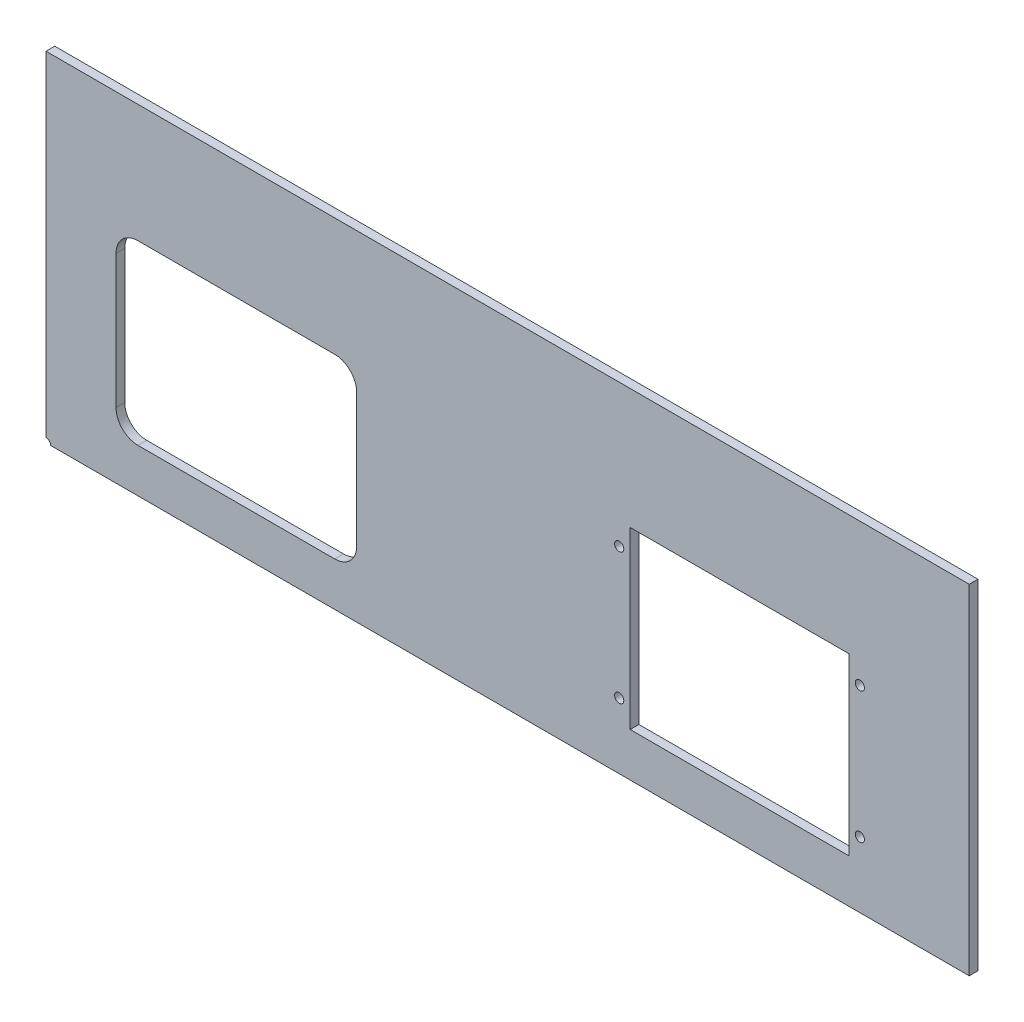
from build123d import *

# Parameters (mm, degrees)
SKETCH1_W           = 422
SKETCH1_H           = 155
BOSS_EXTRUDE1_DEPTH = 4
CUT_EXTRUDE1_DEPTH  = 450.583140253
SKETCH3_R           = 2.1
SKETCH3_W           = 100
SKETCH3_H           = 80
CUT_EXTRUDE2_DEPTH  = 4


with BuildPart() as part:
    # Sketch1 → Boss-Extrude1 (new body)
    with BuildSketch(Plane.XY):
        with Locations((211, 77.5)):
            Rectangle(SKETCH1_W, SKETCH1_H)
    extrude(amount=BOSS_EXTRUDE1_DEPTH)

    # Sketch2 → Cut-Extrude1 (cut, through all)
    with BuildSketch(Plane.XY.offset(4)):
        with BuildLine():
            Line((42, 101), (132, 101))
            ThreePointArc((132, 101), (139.071067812, 98.071067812), (142, 91))
            Line((142, 91), (142, 30))
            ThreePointArc((142, 30), (139.071067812, 22.928932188), (132, 20))
            Line((132, 20), (42, 20))
            ThreePointArc((42, 20), (34.928932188, 22.928932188), (32, 30))
            Line((32, 30), (32, 91))
            ThreePointArc((32, 91), (34.928932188, 98.071067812), (42, 101))
        make_face()
    extrude(amount=-CUT_EXTRUDE1_DEPTH, mode=Mode.SUBTRACT)

    # Sketch3 → Cut-Extrude2 (cut)
    with BuildSketch(Plane.XY.offset(4)):
        Circle(SKETCH3_R)
        with Locations((372, 90)):
            Circle(SKETCH3_R)
        with Locations((372, 30)):
            Circle(SKETCH3_R)
        with Locations(Location((262, 30, 0), (0, 0, 180))):
            Circle(SKETCH3_R)
        with Locations(Location((262, 90, 0), (0, 0, 180))):
            Circle(SKETCH3_R)
        with Locations((317, 60)):
            Rectangle(SKETCH3_W, SKETCH3_H)
    extrude(amount=-CUT_EXTRUDE2_DEPTH, mode=Mode.SUBTRACT)


solid = part.part
